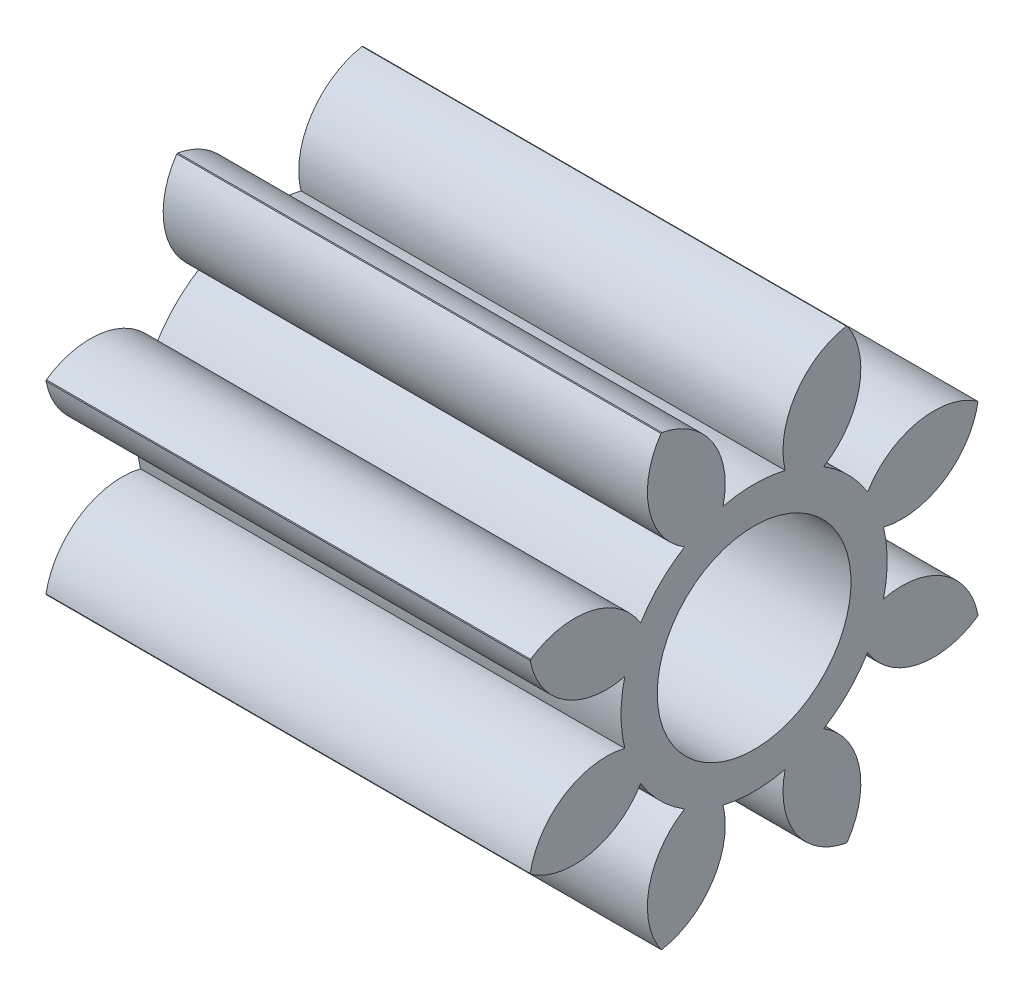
ISO-10303-21;
HEADER;
FILE_DESCRIPTION(('STEP AP214'),'2;1');
FILE_NAME('part.step','',(''),(''),'','','');
FILE_SCHEMA(('AUTOMOTIVE_DESIGN { 1 0 10303 214 1 1 1 1 }'));
ENDSEC;
DATA;
#1=APPLICATION_CONTEXT('core data for automotive mechanical design processes');
#2=APPLICATION_PROTOCOL_DEFINITION('international standard','automotive_design',2000,#1);
#3=PRODUCT_CONTEXT('',#1,'mechanical');
#4=PRODUCT('Part','Part','',(#3));
#5=PRODUCT_RELATED_PRODUCT_CATEGORY('part','',(#4));
#6=PRODUCT_DEFINITION_FORMATION('','',#4);
#7=PRODUCT_DEFINITION_CONTEXT('part definition',#1,'design');
#8=PRODUCT_DEFINITION('design','',#6,#7);
#9=PRODUCT_DEFINITION_SHAPE('','',#8);
#10=(LENGTH_UNIT() NAMED_UNIT(*) SI_UNIT(.MILLI.,.METRE.));
#11=(NAMED_UNIT(*) PLANE_ANGLE_UNIT() SI_UNIT($,.RADIAN.));
#12=(NAMED_UNIT(*) SI_UNIT($,.STERADIAN.) SOLID_ANGLE_UNIT());
#13=UNCERTAINTY_MEASURE_WITH_UNIT(LENGTH_MEASURE(1.E-05),#10,'distance_accuracy_value','');
#14=(GEOMETRIC_REPRESENTATION_CONTEXT(3) GLOBAL_UNCERTAINTY_ASSIGNED_CONTEXT((#13)) GLOBAL_UNIT_ASSIGNED_CONTEXT((#10,
#11,#12)) REPRESENTATION_CONTEXT('',''));
#15=CARTESIAN_POINT('',(0.,0.,0.));
#16=DIRECTION('',(0.,0.,1.));
#17=DIRECTION('',(1.,0.,0.));
#18=AXIS2_PLACEMENT_3D('',#15,#16,#17);
#19=CARTESIAN_POINT('',(5.,0.,0.));
#20=DIRECTION('',(-1.,0.,0.));
#21=DIRECTION('',(0.,0.,1.));
#22=AXIS2_PLACEMENT_3D('',#19,#20,#21);
#23=PLANE('',#22);
#24=CARTESIAN_POINT('',(5.,0.30187640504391,1.85498235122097));
#25=DIRECTION('',(-1.,0.,0.));
#26=DIRECTION('',(0.,0.707106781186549,-0.707106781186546));
#27=AXIS2_PLACEMENT_3D('',#24,#25,#26);
#28=CIRCLE('',#27,0.799999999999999);
#29=CARTESIAN_POINT('',(5.,0.961431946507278,2.30773668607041));
#30=VERTEX_POINT('',#29);
#31=CARTESIAN_POINT('',(5.,0.717795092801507,1.17159984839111));
#32=VERTEX_POINT('',#31);
#33=EDGE_CURVE('E433',#30,#32,#28,.T.);
#34=ORIENTED_EDGE('',*,*,#33,.F.);
#35=CARTESIAN_POINT('',(5.,0.,0.));
#36=DIRECTION('',(-1.,0.,0.));
#37=DIRECTION('',(0.,0.,1.));
#38=AXIS2_PLACEMENT_3D('',#35,#36,#37);
#39=CIRCLE('',#38,2.5);
#40=CARTESIAN_POINT('',(5.,0.951981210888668,2.31165130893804));
#41=VERTEX_POINT('',#40);
#42=EDGE_CURVE('E326',#41,#30,#39,.T.);
#43=ORIENTED_EDGE('',*,*,#42,.F.);
#44=CARTESIAN_POINT('',(5.,1.09821174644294,1.52512945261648));
#45=DIRECTION('',(-1.,0.,0.));
#46=DIRECTION('',(0.,1.,0.));
#47=AXIS2_PLACEMENT_3D('',#44,#45,#46);
#48=CIRCLE('',#47,0.799999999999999);
#49=CARTESIAN_POINT('',(5.,0.320888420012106,1.33600397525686));
#50=VERTEX_POINT('',#49);
#51=EDGE_CURVE('E418',#50,#41,#48,.T.);
#52=ORIENTED_EDGE('',*,*,#51,.F.);
#53=CARTESIAN_POINT('',(5.,0.,0.));
#54=DIRECTION('',(-1.,0.,0.));
#55=DIRECTION('',(0.,1.,0.));
#56=AXIS2_PLACEMENT_3D('',#53,#54,#55);
#57=CIRCLE('',#56,1.374);
#58=CARTESIAN_POINT('',(5.,-0.320888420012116,1.33600397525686));
#59=VERTEX_POINT('',#58);
#60=EDGE_CURVE('E422',#59,#50,#57,.T.);
#61=ORIENTED_EDGE('',*,*,#60,.F.);
#62=CARTESIAN_POINT('',(5.,-1.09821174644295,1.52512945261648));
#63=DIRECTION('',(-1.,0.,0.));
#64=DIRECTION('',(0.,1.,0.));
#65=AXIS2_PLACEMENT_3D('',#62,#63,#64);
#66=CIRCLE('',#65,0.799999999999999);
#67=CARTESIAN_POINT('',(5.,-0.951981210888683,2.31165130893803));
#68=VERTEX_POINT('',#67);
#69=EDGE_CURVE('E420',#68,#59,#66,.T.);
#70=ORIENTED_EDGE('',*,*,#69,.F.);
#71=CARTESIAN_POINT('',(5.,-0.961431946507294,2.3077366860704));
#72=VERTEX_POINT('',#71);
#73=EDGE_CURVE('E300',#72,#68,#39,.T.);
#74=ORIENTED_EDGE('',*,*,#73,.F.);
#75=CARTESIAN_POINT('',(5.,-0.301876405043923,1.85498235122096));
#76=DIRECTION('',(-1.,0.,0.));
#77=DIRECTION('',(0.,0.707106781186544,0.707106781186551));
#78=AXIS2_PLACEMENT_3D('',#75,#76,#77);
#79=CIRCLE('',#78,0.799999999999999);
#80=CARTESIAN_POINT('',(5.,-0.717795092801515,1.17159984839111));
#81=VERTEX_POINT('',#80);
#82=EDGE_CURVE('E404',#81,#72,#79,.T.);
#83=ORIENTED_EDGE('',*,*,#82,.F.);
#84=CARTESIAN_POINT('',(5.,0.,0.));
#85=DIRECTION('',(-1.,0.,0.));
#86=DIRECTION('',(0.,0.707106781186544,0.707106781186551));
#87=AXIS2_PLACEMENT_3D('',#84,#85,#86);
#88=CIRCLE('',#87,1.374);
#89=CARTESIAN_POINT('',(5.,-1.17159984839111,0.717795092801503));
#90=VERTEX_POINT('',#89);
#91=EDGE_CURVE('E408',#90,#81,#88,.T.);
#92=ORIENTED_EDGE('',*,*,#91,.F.);
#93=CARTESIAN_POINT('',(5.,-1.85498235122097,0.301876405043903));
#94=DIRECTION('',(-1.,0.,0.));
#95=DIRECTION('',(0.,0.707106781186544,0.707106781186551));
#96=AXIS2_PLACEMENT_3D('',#93,#94,#95);
#97=CIRCLE('',#96,0.799999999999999);
#98=CARTESIAN_POINT('',(5.,-2.30773668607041,0.961431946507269));
#99=VERTEX_POINT('',#98);
#100=EDGE_CURVE('E406',#99,#90,#97,.T.);
#101=ORIENTED_EDGE('',*,*,#100,.F.);
#102=CARTESIAN_POINT('',(5.,-2.31165130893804,0.951981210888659));
#103=VERTEX_POINT('',#102);
#104=EDGE_CURVE('E337',#103,#99,#39,.T.);
#105=ORIENTED_EDGE('',*,*,#104,.F.);
#106=CARTESIAN_POINT('',(5.,-1.52512945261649,1.09821174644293));
#107=DIRECTION('',(-1.,0.,0.));
#108=DIRECTION('',(0.,0.,1.));
#109=AXIS2_PLACEMENT_3D('',#106,#107,#108);
#110=CIRCLE('',#109,0.799999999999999);
#111=CARTESIAN_POINT('',(5.,-1.33600397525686,0.320888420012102));
#112=VERTEX_POINT('',#111);
#113=EDGE_CURVE('E390',#112,#103,#110,.T.);
#114=ORIENTED_EDGE('',*,*,#113,.F.);
#115=CARTESIAN_POINT('',(5.,0.,0.));
#116=DIRECTION('',(-1.,0.,0.));
#117=DIRECTION('',(0.,0.,1.));
#118=AXIS2_PLACEMENT_3D('',#115,#116,#117);
#119=CIRCLE('',#118,1.374);
#120=CARTESIAN_POINT('',(5.,-1.33600397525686,-0.32088842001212));
#121=VERTEX_POINT('',#120);
#122=EDGE_CURVE('E394',#121,#112,#119,.T.);
#123=ORIENTED_EDGE('',*,*,#122,.F.);
#124=CARTESIAN_POINT('',(5.,-1.52512945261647,-1.09821174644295));
#125=DIRECTION('',(-1.,0.,0.));
#126=DIRECTION('',(0.,0.,1.));
#127=AXIS2_PLACEMENT_3D('',#124,#125,#126);
#128=CIRCLE('',#127,0.799999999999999);
#129=CARTESIAN_POINT('',(5.,-2.31165130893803,-0.951981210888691));
#130=VERTEX_POINT('',#129);
#131=EDGE_CURVE('E392',#130,#121,#128,.T.);
#132=ORIENTED_EDGE('',*,*,#131,.F.);
#133=CARTESIAN_POINT('',(5.,-2.3077366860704,-0.961431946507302));
#134=VERTEX_POINT('',#133);
#135=EDGE_CURVE('E339',#134,#130,#39,.T.);
#136=ORIENTED_EDGE('',*,*,#135,.F.);
#137=CARTESIAN_POINT('',(5.,-1.85498235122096,-0.301876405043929));
#138=DIRECTION('',(-1.,0.,0.));
#139=DIRECTION('',(0.,-0.707106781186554,0.707106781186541));
#140=AXIS2_PLACEMENT_3D('',#137,#138,#139);
#141=CIRCLE('',#140,0.799999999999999);
#142=CARTESIAN_POINT('',(5.,-1.1715998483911,-0.71779509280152));
#143=VERTEX_POINT('',#142);
#144=EDGE_CURVE('E372',#143,#134,#141,.T.);
#145=ORIENTED_EDGE('',*,*,#144,.F.);
#146=CARTESIAN_POINT('',(5.,0.,0.));
#147=DIRECTION('',(-1.,0.,0.));
#148=DIRECTION('',(0.,-0.707106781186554,0.707106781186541));
#149=AXIS2_PLACEMENT_3D('',#146,#147,#148);
#150=CIRCLE('',#149,1.374);
#151=CARTESIAN_POINT('',(5.,-0.717795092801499,-1.17159984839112));
#152=VERTEX_POINT('',#151);
#153=EDGE_CURVE('E369',#152,#143,#150,.T.);
#154=ORIENTED_EDGE('',*,*,#153,.F.);
#155=CARTESIAN_POINT('',(5.,-0.301876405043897,-1.85498235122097));
#156=DIRECTION('',(-1.,0.,0.));
#157=DIRECTION('',(0.,-0.707106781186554,0.707106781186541));
#158=AXIS2_PLACEMENT_3D('',#155,#156,#157);
#159=CIRCLE('',#158,0.799999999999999);
#160=CARTESIAN_POINT('',(5.,-0.961431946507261,-2.30773668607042));
#161=VERTEX_POINT('',#160);
#162=EDGE_CURVE('E367',#161,#152,#159,.T.);
#163=ORIENTED_EDGE('',*,*,#162,.F.);
#164=CARTESIAN_POINT('',(5.,-0.951981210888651,-2.31165130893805));
#165=VERTEX_POINT('',#164);
#166=EDGE_CURVE('E325',#165,#161,#39,.T.);
#167=ORIENTED_EDGE('',*,*,#166,.F.);
#168=CARTESIAN_POINT('',(5.,-1.09821174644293,-1.52512945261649));
#169=DIRECTION('',(-1.,0.,0.));
#170=DIRECTION('',(0.,-1.,0.));
#171=AXIS2_PLACEMENT_3D('',#168,#169,#170);
#172=CIRCLE('',#171,0.799999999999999);
#173=CARTESIAN_POINT('',(5.,-0.320888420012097,-1.33600397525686));
#174=VERTEX_POINT('',#173);
#175=EDGE_CURVE('E365',#174,#165,#172,.T.);
#176=ORIENTED_EDGE('',*,*,#175,.F.);
#177=CARTESIAN_POINT('',(5.,0.,0.));
#178=DIRECTION('',(-1.,0.,0.));
#179=DIRECTION('',(0.,-1.,0.));
#180=AXIS2_PLACEMENT_3D('',#177,#178,#179);
#181=CIRCLE('',#180,1.374);
#182=CARTESIAN_POINT('',(5.,0.320888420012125,-1.33600397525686));
#183=VERTEX_POINT('',#182);
#184=EDGE_CURVE('E615',#183,#174,#181,.T.);
#185=ORIENTED_EDGE('',*,*,#184,.F.);
#186=CARTESIAN_POINT('',(5.,1.09821174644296,-1.52512945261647));
#187=DIRECTION('',(-1.,0.,0.));
#188=DIRECTION('',(0.,-1.,0.));
#189=AXIS2_PLACEMENT_3D('',#186,#187,#188);
#190=CIRCLE('',#189,0.799999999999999);
#191=CARTESIAN_POINT('',(5.,0.9519812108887,-2.31165130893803));
#192=VERTEX_POINT('',#191);
#193=EDGE_CURVE('E613',#192,#183,#190,.T.);
#194=ORIENTED_EDGE('',*,*,#193,.F.);
#195=CARTESIAN_POINT('',(5.,0.96143194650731,-2.3077366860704));
#196=VERTEX_POINT('',#195);
#197=EDGE_CURVE('E320',#196,#192,#39,.T.);
#198=ORIENTED_EDGE('',*,*,#197,.F.);
#199=CARTESIAN_POINT('',(5.,0.301876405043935,-1.85498235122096));
#200=DIRECTION('',(-1.,0.,0.));
#201=DIRECTION('',(0.,-0.707106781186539,-0.707106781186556));
#202=AXIS2_PLACEMENT_3D('',#199,#200,#201);
#203=CIRCLE('',#202,0.799999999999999);
#204=CARTESIAN_POINT('',(5.,0.717795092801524,-1.1715998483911));
#205=VERTEX_POINT('',#204);
#206=EDGE_CURVE('E257',#205,#196,#203,.T.);
#207=ORIENTED_EDGE('',*,*,#206,.F.);
#208=CARTESIAN_POINT('',(5.,0.,0.));
#209=DIRECTION('',(-1.,0.,0.));
#210=DIRECTION('',(0.,-0.707106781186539,-0.707106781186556));
#211=AXIS2_PLACEMENT_3D('',#208,#209,#210);
#212=CIRCLE('',#211,1.374);
#213=CARTESIAN_POINT('',(5.,1.17159984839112,-0.717795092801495));
#214=VERTEX_POINT('',#213);
#215=EDGE_CURVE('E604',#214,#205,#212,.T.);
#216=ORIENTED_EDGE('',*,*,#215,.F.);
#217=CARTESIAN_POINT('',(5.,1.85498235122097,-0.30187640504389));
#218=DIRECTION('',(-1.,0.,0.));
#219=DIRECTION('',(0.,-0.707106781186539,-0.707106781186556));
#220=AXIS2_PLACEMENT_3D('',#217,#218,#219);
#221=CIRCLE('',#220,0.799999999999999);
#222=CARTESIAN_POINT('',(5.,2.30773668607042,-0.961431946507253));
#223=VERTEX_POINT('',#222);
#224=EDGE_CURVE('E244',#223,#214,#221,.T.);
#225=ORIENTED_EDGE('',*,*,#224,.F.);
#226=CARTESIAN_POINT('',(5.,2.31165130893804,-0.951981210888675));
#227=VERTEX_POINT('',#226);
#228=EDGE_CURVE('E273',#227,#223,#39,.T.);
#229=ORIENTED_EDGE('',*,*,#228,.F.);
#230=CARTESIAN_POINT('',(5.,1.52512945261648,-1.09821174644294));
#231=DIRECTION('',(-1.,0.,0.));
#232=DIRECTION('',(0.,0.,-1.));
#233=AXIS2_PLACEMENT_3D('',#230,#231,#232);
#234=CIRCLE('',#233,0.799999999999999);
#235=CARTESIAN_POINT('',(5.,1.33600397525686,-0.320888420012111));
#236=VERTEX_POINT('',#235);
#237=EDGE_CURVE('E468',#236,#227,#234,.T.);
#238=ORIENTED_EDGE('',*,*,#237,.F.);
#239=CARTESIAN_POINT('',(5.,0.,0.));
#240=DIRECTION('',(-1.,0.,0.));
#241=DIRECTION('',(0.,0.,-1.));
#242=AXIS2_PLACEMENT_3D('',#239,#240,#241);
#243=CIRCLE('',#242,1.374);
#244=CARTESIAN_POINT('',(5.,1.33600397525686,0.320888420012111));
#245=VERTEX_POINT('',#244);
#246=EDGE_CURVE('E472',#245,#236,#243,.T.);
#247=ORIENTED_EDGE('',*,*,#246,.F.);
#248=CARTESIAN_POINT('',(5.,1.52512945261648,1.09821174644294));
#249=DIRECTION('',(-1.,0.,0.));
#250=DIRECTION('',(0.,0.,-1.));
#251=AXIS2_PLACEMENT_3D('',#248,#249,#250);
#252=CIRCLE('',#251,0.799999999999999);
#253=CARTESIAN_POINT('',(5.,2.31165130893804,0.951981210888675));
#254=VERTEX_POINT('',#253);
#255=EDGE_CURVE('E470',#254,#245,#252,.T.);
#256=ORIENTED_EDGE('',*,*,#255,.F.);
#257=CARTESIAN_POINT('',(5.,2.30773668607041,0.961431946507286));
#258=VERTEX_POINT('',#257);
#259=EDGE_CURVE('E315',#258,#254,#39,.T.);
#260=ORIENTED_EDGE('',*,*,#259,.F.);
#261=CARTESIAN_POINT('',(5.,1.85498235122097,0.301876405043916));
#262=DIRECTION('',(-1.,0.,0.));
#263=DIRECTION('',(0.,0.707106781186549,-0.707106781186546));
#264=AXIS2_PLACEMENT_3D('',#261,#262,#263);
#265=CIRCLE('',#264,0.799999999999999);
#266=CARTESIAN_POINT('',(5.,1.17159984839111,0.717795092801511));
#267=VERTEX_POINT('',#266);
#268=EDGE_CURVE('E431',#267,#258,#265,.T.);
#269=ORIENTED_EDGE('',*,*,#268,.F.);
#270=CARTESIAN_POINT('',(5.,0.,0.));
#271=DIRECTION('',(-1.,0.,0.));
#272=DIRECTION('',(0.,0.707106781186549,-0.707106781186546));
#273=AXIS2_PLACEMENT_3D('',#270,#271,#272);
#274=CIRCLE('',#273,1.374);
#275=EDGE_CURVE('E435',#32,#267,#274,.T.);
#276=ORIENTED_EDGE('',*,*,#275,.F.);
#277=EDGE_LOOP('',(#34,#43,#52,#61,#70,#74,#83,#92,#101,#105,#114,#123,#132,#136,#145,#154,#163,
#167,#176,#185,#194,#198,#207,#216,#225,#229,#238,#247,#256,#260,#269,#276));
#278=FACE_BOUND('',#277,.T.);
#279=CARTESIAN_POINT('',(5.,0.,0.));
#280=DIRECTION('',(-1.,0.,0.));
#281=DIRECTION('',(0.,0.,1.));
#282=AXIS2_PLACEMENT_3D('',#279,#280,#281);
#283=CIRCLE('',#282,0.999999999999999);
#284=CARTESIAN_POINT('',(5.,0.,0.999999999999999));
#285=VERTEX_POINT('',#284);
#286=EDGE_CURVE('E598',#285,#285,#283,.F.);
#287=ORIENTED_EDGE('',*,*,#286,.F.);
#288=EDGE_LOOP('',(#287));
#289=FACE_BOUND('',#288,.T.);
#290=ADVANCED_FACE('F28',(#278,#289),#23,.F.);
#291=CARTESIAN_POINT('',(0.,0.,0.));
#292=DIRECTION('',(1.,0.,0.));
#293=DIRECTION('',(0.,0.,-1.));
#294=AXIS2_PLACEMENT_3D('',#291,#292,#293);
#295=PLANE('',#294);
#296=CARTESIAN_POINT('',(0.,0.30187640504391,1.85498235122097));
#297=DIRECTION('',(1.,0.,0.));
#298=DIRECTION('',(0.,0.,-1.));
#299=AXIS2_PLACEMENT_3D('',#296,#297,#298);
#300=CIRCLE('',#299,0.799999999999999);
#301=CARTESIAN_POINT('',(0.,0.717795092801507,1.17159984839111));
#302=VERTEX_POINT('',#301);
#303=CARTESIAN_POINT('',(0.,0.961431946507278,2.30773668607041));
#304=VERTEX_POINT('',#303);
#305=EDGE_CURVE('E11',#302,#304,#300,.T.);
#306=ORIENTED_EDGE('',*,*,#305,.F.);
#307=CARTESIAN_POINT('',(0.,0.,0.));
#308=DIRECTION('',(-1.,0.,0.));
#309=DIRECTION('',(0.,0.707106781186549,-0.707106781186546));
#310=AXIS2_PLACEMENT_3D('',#307,#308,#309);
#311=CIRCLE('',#310,1.374);
#312=CARTESIAN_POINT('',(0.,1.17159984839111,0.717795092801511));
#313=VERTEX_POINT('',#312);
#314=EDGE_CURVE('E428',#302,#313,#311,.T.);
#315=ORIENTED_EDGE('',*,*,#314,.T.);
#316=CARTESIAN_POINT('',(0.,1.85498235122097,0.301876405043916));
#317=DIRECTION('',(-1.,0.,0.));
#318=DIRECTION('',(0.,0.707106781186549,-0.707106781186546));
#319=AXIS2_PLACEMENT_3D('',#316,#317,#318);
#320=CIRCLE('',#319,0.799999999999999);
#321=CARTESIAN_POINT('',(0.,2.30773668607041,0.961431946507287));
#322=VERTEX_POINT('',#321);
#323=EDGE_CURVE('E43',#313,#322,#320,.T.);
#324=ORIENTED_EDGE('',*,*,#323,.T.);
#325=CARTESIAN_POINT('',(0.,0.,0.));
#326=DIRECTION('',(-1.,0.,0.));
#327=DIRECTION('',(0.,0.,1.));
#328=AXIS2_PLACEMENT_3D('',#325,#326,#327);
#329=CIRCLE('',#328,2.5);
#330=CARTESIAN_POINT('',(0.,2.31165130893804,0.951981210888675));
#331=VERTEX_POINT('',#330);
#332=EDGE_CURVE('E313',#322,#331,#329,.T.);
#333=ORIENTED_EDGE('',*,*,#332,.T.);
#334=CARTESIAN_POINT('',(0.,1.52512945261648,1.09821174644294));
#335=DIRECTION('',(1.,0.,0.));
#336=DIRECTION('',(0.,0.,-1.));
#337=AXIS2_PLACEMENT_3D('',#334,#335,#336);
#338=CIRCLE('',#337,0.799999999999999);
#339=CARTESIAN_POINT('',(0.,1.33600397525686,0.320888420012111));
#340=VERTEX_POINT('',#339);
#341=EDGE_CURVE('E268',#340,#331,#338,.T.);
#342=ORIENTED_EDGE('',*,*,#341,.F.);
#343=CARTESIAN_POINT('',(0.,0.,0.));
#344=DIRECTION('',(-1.,0.,0.));
#345=DIRECTION('',(0.,0.,-1.));
#346=AXIS2_PLACEMENT_3D('',#343,#344,#345);
#347=CIRCLE('',#346,1.374);
#348=CARTESIAN_POINT('',(0.,1.33600397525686,-0.320888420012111));
#349=VERTEX_POINT('',#348);
#350=EDGE_CURVE('E465',#340,#349,#347,.T.);
#351=ORIENTED_EDGE('',*,*,#350,.T.);
#352=CARTESIAN_POINT('',(0.,1.52512945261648,-1.09821174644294));
#353=DIRECTION('',(-1.,0.,0.));
#354=DIRECTION('',(0.,0.,-1.));
#355=AXIS2_PLACEMENT_3D('',#352,#353,#354);
#356=CIRCLE('',#355,0.799999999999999);
#357=CARTESIAN_POINT('',(0.,2.31165130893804,-0.951981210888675));
#358=VERTEX_POINT('',#357);
#359=EDGE_CURVE('E463',#349,#358,#356,.T.);
#360=ORIENTED_EDGE('',*,*,#359,.T.);
#361=CARTESIAN_POINT('',(0.,2.30773668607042,-0.961431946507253));
#362=VERTEX_POINT('',#361);
#363=EDGE_CURVE('E266',#358,#362,#329,.T.);
#364=ORIENTED_EDGE('',*,*,#363,.T.);
#365=CARTESIAN_POINT('',(0.,1.85498235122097,-0.30187640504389));
#366=DIRECTION('',(1.,0.,0.));
#367=DIRECTION('',(0.,0.,-1.));
#368=AXIS2_PLACEMENT_3D('',#365,#366,#367);
#369=CIRCLE('',#368,0.799999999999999);
#370=CARTESIAN_POINT('',(0.,1.17159984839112,-0.717795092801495));
#371=VERTEX_POINT('',#370);
#372=EDGE_CURVE('E241',#371,#362,#369,.T.);
#373=ORIENTED_EDGE('',*,*,#372,.F.);
#374=CARTESIAN_POINT('',(0.,0.,0.));
#375=DIRECTION('',(-1.,0.,0.));
#376=DIRECTION('',(0.,-0.707106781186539,-0.707106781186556));
#377=AXIS2_PLACEMENT_3D('',#374,#375,#376);
#378=CIRCLE('',#377,1.374);
#379=CARTESIAN_POINT('',(0.,0.717795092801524,-1.1715998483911));
#380=VERTEX_POINT('',#379);
#381=EDGE_CURVE('E252',#371,#380,#378,.T.);
#382=ORIENTED_EDGE('',*,*,#381,.T.);
#383=CARTESIAN_POINT('',(0.,0.301876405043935,-1.85498235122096));
#384=DIRECTION('',(-1.,0.,0.));
#385=DIRECTION('',(0.,-0.707106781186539,-0.707106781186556));
#386=AXIS2_PLACEMENT_3D('',#383,#384,#385);
#387=CIRCLE('',#386,0.799999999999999);
#388=CARTESIAN_POINT('',(0.,0.96143194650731,-2.3077366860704));
#389=VERTEX_POINT('',#388);
#390=EDGE_CURVE('E258',#380,#389,#387,.T.);
#391=ORIENTED_EDGE('',*,*,#390,.T.);
#392=CARTESIAN_POINT('',(0.,0.951981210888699,-2.31165130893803));
#393=VERTEX_POINT('',#392);
#394=EDGE_CURVE('E316',#389,#393,#329,.T.);
#395=ORIENTED_EDGE('',*,*,#394,.T.);
#396=CARTESIAN_POINT('',(0.,1.09821174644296,-1.52512945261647));
#397=DIRECTION('',(1.,0.,0.));
#398=DIRECTION('',(0.,0.,-1.));
#399=AXIS2_PLACEMENT_3D('',#396,#397,#398);
#400=CIRCLE('',#399,0.799999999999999);
#401=CARTESIAN_POINT('',(0.,0.320888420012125,-1.33600397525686));
#402=VERTEX_POINT('',#401);
#403=EDGE_CURVE('E267',#402,#393,#400,.T.);
#404=ORIENTED_EDGE('',*,*,#403,.F.);
#405=CARTESIAN_POINT('',(0.,0.,0.));
#406=DIRECTION('',(-1.,0.,0.));
#407=DIRECTION('',(0.,-1.,0.));
#408=AXIS2_PLACEMENT_3D('',#405,#406,#407);
#409=CIRCLE('',#408,1.374);
#410=CARTESIAN_POINT('',(0.,-0.320888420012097,-1.33600397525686));
#411=VERTEX_POINT('',#410);
#412=EDGE_CURVE('E609',#402,#411,#409,.T.);
#413=ORIENTED_EDGE('',*,*,#412,.T.);
#414=CARTESIAN_POINT('',(0.,-1.09821174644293,-1.52512945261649));
#415=DIRECTION('',(-1.,0.,0.));
#416=DIRECTION('',(0.,-1.,0.));
#417=AXIS2_PLACEMENT_3D('',#414,#415,#416);
#418=CIRCLE('',#417,0.799999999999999);
#419=CARTESIAN_POINT('',(0.,-0.951981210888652,-2.31165130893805));
#420=VERTEX_POINT('',#419);
#421=EDGE_CURVE('E247',#411,#420,#418,.T.);
#422=ORIENTED_EDGE('',*,*,#421,.T.);
#423=CARTESIAN_POINT('',(0.,-0.961431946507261,-2.30773668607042));
#424=VERTEX_POINT('',#423);
#425=EDGE_CURVE('E638',#420,#424,#329,.T.);
#426=ORIENTED_EDGE('',*,*,#425,.T.);
#427=CARTESIAN_POINT('',(0.,-0.301876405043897,-1.85498235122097));
#428=DIRECTION('',(1.,0.,0.));
#429=DIRECTION('',(0.,0.,-1.));
#430=AXIS2_PLACEMENT_3D('',#427,#428,#429);
#431=CIRCLE('',#430,0.799999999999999);
#432=CARTESIAN_POINT('',(0.,-0.717795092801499,-1.17159984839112));
#433=VERTEX_POINT('',#432);
#434=EDGE_CURVE('E270',#433,#424,#431,.T.);
#435=ORIENTED_EDGE('',*,*,#434,.F.);
#436=CARTESIAN_POINT('',(0.,0.,0.));
#437=DIRECTION('',(-1.,0.,0.));
#438=DIRECTION('',(0.,-0.707106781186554,0.707106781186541));
#439=AXIS2_PLACEMENT_3D('',#436,#437,#438);
#440=CIRCLE('',#439,1.374);
#441=CARTESIAN_POINT('',(0.,-1.1715998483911,-0.71779509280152));
#442=VERTEX_POINT('',#441);
#443=EDGE_CURVE('E376',#433,#442,#440,.T.);
#444=ORIENTED_EDGE('',*,*,#443,.T.);
#445=CARTESIAN_POINT('',(0.,-1.85498235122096,-0.301876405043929));
#446=DIRECTION('',(-1.,0.,0.));
#447=DIRECTION('',(0.,-0.707106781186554,0.707106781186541));
#448=AXIS2_PLACEMENT_3D('',#445,#446,#447);
#449=CIRCLE('',#448,0.799999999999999);
#450=CARTESIAN_POINT('',(0.,-2.3077366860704,-0.961431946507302));
#451=VERTEX_POINT('',#450);
#452=EDGE_CURVE('E622',#442,#451,#449,.T.);
#453=ORIENTED_EDGE('',*,*,#452,.T.);
#454=CARTESIAN_POINT('',(0.,-2.31165130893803,-0.951981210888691));
#455=VERTEX_POINT('',#454);
#456=EDGE_CURVE('E311',#451,#455,#329,.T.);
#457=ORIENTED_EDGE('',*,*,#456,.T.);
#458=CARTESIAN_POINT('',(0.,-1.52512945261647,-1.09821174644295));
#459=DIRECTION('',(1.,0.,0.));
#460=DIRECTION('',(0.,0.,-1.));
#461=AXIS2_PLACEMENT_3D('',#458,#459,#460);
#462=CIRCLE('',#461,0.799999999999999);
#463=CARTESIAN_POINT('',(0.,-1.33600397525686,-0.32088842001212));
#464=VERTEX_POINT('',#463);
#465=EDGE_CURVE('E278',#464,#455,#462,.T.);
#466=ORIENTED_EDGE('',*,*,#465,.F.);
#467=CARTESIAN_POINT('',(0.,0.,0.));
#468=DIRECTION('',(-1.,0.,0.));
#469=DIRECTION('',(0.,0.,1.));
#470=AXIS2_PLACEMENT_3D('',#467,#468,#469);
#471=CIRCLE('',#470,1.374);
#472=CARTESIAN_POINT('',(0.,-1.33600397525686,0.320888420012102));
#473=VERTEX_POINT('',#472);
#474=EDGE_CURVE('E387',#464,#473,#471,.T.);
#475=ORIENTED_EDGE('',*,*,#474,.T.);
#476=CARTESIAN_POINT('',(0.,-1.52512945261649,1.09821174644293));
#477=DIRECTION('',(-1.,0.,0.));
#478=DIRECTION('',(0.,0.,1.));
#479=AXIS2_PLACEMENT_3D('',#476,#477,#478);
#480=CIRCLE('',#479,0.799999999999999);
#481=CARTESIAN_POINT('',(0.,-2.31165130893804,0.95198121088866));
#482=VERTEX_POINT('',#481);
#483=EDGE_CURVE('E384',#473,#482,#480,.T.);
#484=ORIENTED_EDGE('',*,*,#483,.T.);
#485=CARTESIAN_POINT('',(0.,-2.30773668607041,0.96143194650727));
#486=VERTEX_POINT('',#485);
#487=EDGE_CURVE('E307',#482,#486,#329,.T.);
#488=ORIENTED_EDGE('',*,*,#487,.T.);
#489=CARTESIAN_POINT('',(0.,-1.85498235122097,0.301876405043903));
#490=DIRECTION('',(1.,0.,0.));
#491=DIRECTION('',(0.,0.,-1.));
#492=AXIS2_PLACEMENT_3D('',#489,#490,#491);
#493=CIRCLE('',#492,0.799999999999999);
#494=CARTESIAN_POINT('',(0.,-1.17159984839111,0.717795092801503));
#495=VERTEX_POINT('',#494);
#496=EDGE_CURVE('E280',#495,#486,#493,.T.);
#497=ORIENTED_EDGE('',*,*,#496,.F.);
#498=CARTESIAN_POINT('',(0.,0.,0.));
#499=DIRECTION('',(-1.,0.,0.));
#500=DIRECTION('',(0.,0.707106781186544,0.707106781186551));
#501=AXIS2_PLACEMENT_3D('',#498,#499,#500);
#502=CIRCLE('',#501,1.374);
#503=CARTESIAN_POINT('',(0.,-0.717795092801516,1.17159984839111));
#504=VERTEX_POINT('',#503);
#505=EDGE_CURVE('E402',#495,#504,#502,.T.);
#506=ORIENTED_EDGE('',*,*,#505,.T.);
#507=CARTESIAN_POINT('',(0.,-0.301876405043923,1.85498235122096));
#508=DIRECTION('',(-1.,0.,0.));
#509=DIRECTION('',(0.,0.707106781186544,0.707106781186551));
#510=AXIS2_PLACEMENT_3D('',#507,#508,#509);
#511=CIRCLE('',#510,0.799999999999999);
#512=CARTESIAN_POINT('',(0.,-0.961431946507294,2.3077366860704));
#513=VERTEX_POINT('',#512);
#514=EDGE_CURVE('E306',#504,#513,#511,.T.);
#515=ORIENTED_EDGE('',*,*,#514,.T.);
#516=CARTESIAN_POINT('',(0.,-0.951981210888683,2.31165130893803));
#517=VERTEX_POINT('',#516);
#518=EDGE_CURVE('E298',#513,#517,#329,.T.);
#519=ORIENTED_EDGE('',*,*,#518,.T.);
#520=CARTESIAN_POINT('',(0.,-1.09821174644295,1.52512945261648));
#521=DIRECTION('',(1.,0.,0.));
#522=DIRECTION('',(0.,0.,-1.));
#523=AXIS2_PLACEMENT_3D('',#520,#521,#522);
#524=CIRCLE('',#523,0.799999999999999);
#525=CARTESIAN_POINT('',(0.,-0.320888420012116,1.33600397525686));
#526=VERTEX_POINT('',#525);
#527=EDGE_CURVE('E36',#526,#517,#524,.T.);
#528=ORIENTED_EDGE('',*,*,#527,.F.);
#529=CARTESIAN_POINT('',(0.,0.,0.));
#530=DIRECTION('',(-1.,0.,0.));
#531=DIRECTION('',(0.,1.,0.));
#532=AXIS2_PLACEMENT_3D('',#529,#530,#531);
#533=CIRCLE('',#532,1.374);
#534=CARTESIAN_POINT('',(0.,0.320888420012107,1.33600397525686));
#535=VERTEX_POINT('',#534);
#536=EDGE_CURVE('E416',#526,#535,#533,.T.);
#537=ORIENTED_EDGE('',*,*,#536,.T.);
#538=CARTESIAN_POINT('',(0.,1.09821174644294,1.52512945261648));
#539=DIRECTION('',(-1.,0.,0.));
#540=DIRECTION('',(0.,1.,0.));
#541=AXIS2_PLACEMENT_3D('',#538,#539,#540);
#542=CIRCLE('',#541,0.799999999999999);
#543=CARTESIAN_POINT('',(0.,0.951981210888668,2.31165130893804));
#544=VERTEX_POINT('',#543);
#545=EDGE_CURVE('E51',#535,#544,#542,.T.);
#546=ORIENTED_EDGE('',*,*,#545,.T.);
#547=EDGE_CURVE('E308',#544,#304,#329,.T.);
#548=ORIENTED_EDGE('',*,*,#547,.T.);
#549=EDGE_LOOP('',(#306,#315,#324,#333,#342,#351,#360,#364,#373,#382,#391,#395,#404,#413,#422,
#426,#435,#444,#453,#457,#466,#475,#484,#488,#497,#506,#515,#519,#528,#537,#546,#548));
#550=FACE_BOUND('',#549,.T.);
#551=CARTESIAN_POINT('',(0.,0.,0.));
#552=DIRECTION('',(1.,0.,0.));
#553=DIRECTION('',(0.,0.,-1.));
#554=AXIS2_PLACEMENT_3D('',#551,#552,#553);
#555=CIRCLE('',#554,0.999999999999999);
#556=CARTESIAN_POINT('',(0.,0.,-0.999999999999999));
#557=VERTEX_POINT('',#556);
#558=EDGE_CURVE('E31',#557,#557,#555,.F.);
#559=ORIENTED_EDGE('',*,*,#558,.F.);
#560=EDGE_LOOP('',(#559));
#561=FACE_BOUND('',#560,.T.);
#562=ADVANCED_FACE('F262',(#550,#561),#295,.F.);
#563=CARTESIAN_POINT('',(-10.,0.,0.));
#564=DIRECTION('',(-1.,0.,0.));
#565=DIRECTION('',(0.,0.,1.));
#566=AXIS2_PLACEMENT_3D('',#563,#564,#565);
#567=CYLINDRICAL_SURFACE('',#566,2.5);
#568=DIRECTION('',(-1.,0.,0.));
#569=VECTOR('',#568,1.);
#570=CARTESIAN_POINT('',(2.5,0.961431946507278,2.30773668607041));
#571=LINE('',#570,#569);
#572=EDGE_CURVE('E461',#304,#30,#571,.F.);
#573=ORIENTED_EDGE('',*,*,#572,.F.);
#574=ORIENTED_EDGE('',*,*,#547,.F.);
#575=DIRECTION('',(-1.,0.,0.));
#576=VECTOR('',#575,1.);
#577=CARTESIAN_POINT('',(2.5,0.951981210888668,2.31165130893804));
#578=LINE('',#577,#576);
#579=EDGE_CURVE('E301',#41,#544,#578,.T.);
#580=ORIENTED_EDGE('',*,*,#579,.F.);
#581=ORIENTED_EDGE('',*,*,#42,.T.);
#582=EDGE_LOOP('',(#573,#574,#580,#581));
#583=FACE_BOUND('',#582,.T.);
#584=ADVANCED_FACE('F489',(#583),#567,.T.);
#585=DIRECTION('',(-1.,0.,0.));
#586=VECTOR('',#585,1.);
#587=CARTESIAN_POINT('',(2.5,2.30773668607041,0.961431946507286));
#588=LINE('',#587,#586);
#589=EDGE_CURVE('E459',#258,#322,#588,.T.);
#590=ORIENTED_EDGE('',*,*,#589,.F.);
#591=ORIENTED_EDGE('',*,*,#259,.T.);
#592=DIRECTION('',(-1.,0.,0.));
#593=VECTOR('',#592,1.);
#594=CARTESIAN_POINT('',(2.5,2.31165130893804,0.951981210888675));
#595=LINE('',#594,#593);
#596=EDGE_CURVE('E478',#331,#254,#595,.F.);
#597=ORIENTED_EDGE('',*,*,#596,.F.);
#598=ORIENTED_EDGE('',*,*,#332,.F.);
#599=EDGE_LOOP('',(#590,#591,#597,#598));
#600=FACE_BOUND('',#599,.T.);
#601=ADVANCED_FACE('F487',(#600),#567,.T.);
#602=DIRECTION('',(-1.,0.,0.));
#603=VECTOR('',#602,1.);
#604=CARTESIAN_POINT('',(2.5,-0.951981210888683,2.31165130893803));
#605=LINE('',#604,#603);
#606=EDGE_CURVE('E286',#517,#68,#605,.F.);
#607=ORIENTED_EDGE('',*,*,#606,.F.);
#608=ORIENTED_EDGE('',*,*,#518,.F.);
#609=DIRECTION('',(-1.,0.,0.));
#610=VECTOR('',#609,1.);
#611=CARTESIAN_POINT('',(2.5,-0.961431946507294,2.3077366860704));
#612=LINE('',#611,#610);
#613=EDGE_CURVE('E302',#72,#513,#612,.T.);
#614=ORIENTED_EDGE('',*,*,#613,.F.);
#615=ORIENTED_EDGE('',*,*,#73,.T.);
#616=EDGE_LOOP('',(#607,#608,#614,#615));
#617=FACE_BOUND('',#616,.T.);
#618=ADVANCED_FACE('F296',(#617),#567,.T.);
#619=DIRECTION('',(-1.,0.,0.));
#620=VECTOR('',#619,1.);
#621=CARTESIAN_POINT('',(2.5,-2.30773668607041,0.96143194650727));
#622=LINE('',#621,#620);
#623=EDGE_CURVE('E455',#486,#99,#622,.F.);
#624=ORIENTED_EDGE('',*,*,#623,.F.);
#625=ORIENTED_EDGE('',*,*,#487,.F.);
#626=DIRECTION('',(-1.,0.,0.));
#627=VECTOR('',#626,1.);
#628=CARTESIAN_POINT('',(2.5,-2.31165130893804,0.95198121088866));
#629=LINE('',#628,#627);
#630=EDGE_CURVE('E453',#103,#482,#629,.T.);
#631=ORIENTED_EDGE('',*,*,#630,.F.);
#632=ORIENTED_EDGE('',*,*,#104,.T.);
#633=EDGE_LOOP('',(#624,#625,#631,#632));
#634=FACE_BOUND('',#633,.T.);
#635=ADVANCED_FACE('F494',(#634),#567,.T.);
#636=DIRECTION('',(-1.,0.,0.));
#637=VECTOR('',#636,1.);
#638=CARTESIAN_POINT('',(2.5,-2.31165130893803,-0.951981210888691));
#639=LINE('',#638,#637);
#640=EDGE_CURVE('E451',#455,#130,#639,.F.);
#641=ORIENTED_EDGE('',*,*,#640,.F.);
#642=ORIENTED_EDGE('',*,*,#456,.F.);
#643=DIRECTION('',(-1.,0.,0.));
#644=VECTOR('',#643,1.);
#645=CARTESIAN_POINT('',(2.5,-2.3077366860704,-0.961431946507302));
#646=LINE('',#645,#644);
#647=EDGE_CURVE('E449',#134,#451,#646,.T.);
#648=ORIENTED_EDGE('',*,*,#647,.F.);
#649=ORIENTED_EDGE('',*,*,#135,.T.);
#650=EDGE_LOOP('',(#641,#642,#648,#649));
#651=FACE_BOUND('',#650,.T.);
#652=ADVANCED_FACE('F637',(#651),#567,.T.);
#653=DIRECTION('',(-1.,0.,0.));
#654=VECTOR('',#653,1.);
#655=CARTESIAN_POINT('',(2.5,-0.961431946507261,-2.30773668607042));
#656=LINE('',#655,#654);
#657=EDGE_CURVE('E356',#424,#161,#656,.F.);
#658=ORIENTED_EDGE('',*,*,#657,.F.);
#659=ORIENTED_EDGE('',*,*,#425,.F.);
#660=DIRECTION('',(-1.,0.,0.));
#661=VECTOR('',#660,1.);
#662=CARTESIAN_POINT('',(2.5,-0.951981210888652,-2.31165130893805));
#663=LINE('',#662,#661);
#664=EDGE_CURVE('E358',#165,#420,#663,.T.);
#665=ORIENTED_EDGE('',*,*,#664,.F.);
#666=ORIENTED_EDGE('',*,*,#166,.T.);
#667=EDGE_LOOP('',(#658,#659,#665,#666));
#668=FACE_BOUND('',#667,.T.);
#669=ADVANCED_FACE('F354',(#668),#567,.T.);
#670=DIRECTION('',(-1.,0.,0.));
#671=VECTOR('',#670,1.);
#672=CARTESIAN_POINT('',(2.5,0.951981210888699,-2.31165130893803));
#673=LINE('',#672,#671);
#674=EDGE_CURVE('E445',#393,#192,#673,.F.);
#675=ORIENTED_EDGE('',*,*,#674,.F.);
#676=ORIENTED_EDGE('',*,*,#394,.F.);
#677=DIRECTION('',(-1.,0.,0.));
#678=VECTOR('',#677,1.);
#679=CARTESIAN_POINT('',(2.5,0.96143194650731,-2.3077366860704));
#680=LINE('',#679,#678);
#681=EDGE_CURVE('E443',#196,#389,#680,.T.);
#682=ORIENTED_EDGE('',*,*,#681,.F.);
#683=ORIENTED_EDGE('',*,*,#197,.T.);
#684=EDGE_LOOP('',(#675,#676,#682,#683));
#685=FACE_BOUND('',#684,.T.);
#686=ADVANCED_FACE('F645',(#685),#567,.T.);
#687=DIRECTION('',(-1.,0.,0.));
#688=VECTOR('',#687,1.);
#689=CARTESIAN_POINT('',(2.5,2.30773668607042,-0.961431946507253));
#690=LINE('',#689,#688);
#691=EDGE_CURVE('E441',#362,#223,#690,.F.);
#692=ORIENTED_EDGE('',*,*,#691,.F.);
#693=ORIENTED_EDGE('',*,*,#363,.F.);
#694=DIRECTION('',(-1.,0.,0.));
#695=VECTOR('',#694,1.);
#696=CARTESIAN_POINT('',(2.5,2.31165130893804,-0.951981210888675));
#697=LINE('',#696,#695);
#698=EDGE_CURVE('E317',#227,#358,#697,.T.);
#699=ORIENTED_EDGE('',*,*,#698,.F.);
#700=ORIENTED_EDGE('',*,*,#228,.T.);
#701=EDGE_LOOP('',(#692,#693,#699,#700));
#702=FACE_BOUND('',#701,.T.);
#703=ADVANCED_FACE('F495',(#702),#567,.T.);
#704=CARTESIAN_POINT('',(5.,1.52512945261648,-1.09821174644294));
#705=DIRECTION('',(-1.,0.,0.));
#706=DIRECTION('',(0.,0.,1.));
#707=AXIS2_PLACEMENT_3D('',#704,#705,#706);
#708=CYLINDRICAL_SURFACE('',#707,0.799999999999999);
#709=ORIENTED_EDGE('',*,*,#698,.T.);
#710=ORIENTED_EDGE('',*,*,#359,.F.);
#711=DIRECTION('',(-1.,0.,0.));
#712=VECTOR('',#711,1.);
#713=CARTESIAN_POINT('',(5.,1.33600397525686,-0.320888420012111));
#714=LINE('',#713,#712);
#715=EDGE_CURVE('E474',#236,#349,#714,.T.);
#716=ORIENTED_EDGE('',*,*,#715,.F.);
#717=ORIENTED_EDGE('',*,*,#237,.T.);
#718=EDGE_LOOP('',(#709,#710,#716,#717));
#719=FACE_BOUND('',#718,.T.);
#720=ADVANCED_FACE('F506',(#719),#708,.T.);
#721=CARTESIAN_POINT('',(5.,1.52512945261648,1.09821174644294));
#722=DIRECTION('',(-1.,0.,0.));
#723=DIRECTION('',(0.,0.,1.));
#724=AXIS2_PLACEMENT_3D('',#721,#722,#723);
#725=CYLINDRICAL_SURFACE('',#724,0.799999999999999);
#726=ORIENTED_EDGE('',*,*,#596,.T.);
#727=ORIENTED_EDGE('',*,*,#255,.T.);
#728=DIRECTION('',(-1.,0.,0.));
#729=VECTOR('',#728,1.);
#730=CARTESIAN_POINT('',(5.,1.33600397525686,0.320888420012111));
#731=LINE('',#730,#729);
#732=EDGE_CURVE('E477',#245,#340,#731,.T.);
#733=ORIENTED_EDGE('',*,*,#732,.T.);
#734=ORIENTED_EDGE('',*,*,#341,.T.);
#735=EDGE_LOOP('',(#726,#727,#733,#734));
#736=FACE_BOUND('',#735,.T.);
#737=ADVANCED_FACE('F484',(#736),#725,.T.);
#738=CARTESIAN_POINT('',(5.,0.,0.));
#739=DIRECTION('',(-1.,0.,0.));
#740=DIRECTION('',(0.,0.,1.));
#741=AXIS2_PLACEMENT_3D('',#738,#739,#740);
#742=CYLINDRICAL_SURFACE('',#741,1.374);
#743=ORIENTED_EDGE('',*,*,#350,.F.);
#744=ORIENTED_EDGE('',*,*,#732,.F.);
#745=ORIENTED_EDGE('',*,*,#246,.T.);
#746=ORIENTED_EDGE('',*,*,#715,.T.);
#747=EDGE_LOOP('',(#743,#744,#745,#746));
#748=FACE_BOUND('',#747,.T.);
#749=ADVANCED_FACE('F511',(#748),#742,.T.);
#750=CARTESIAN_POINT('',(5.,0.,0.));
#751=DIRECTION('',(-1.,0.,0.));
#752=DIRECTION('',(0.,0.,1.));
#753=AXIS2_PLACEMENT_3D('',#750,#751,#752);
#754=CYLINDRICAL_SURFACE('',#753,1.374);
#755=ORIENTED_EDGE('',*,*,#381,.F.);
#756=DIRECTION('',(-1.,0.,0.));
#757=VECTOR('',#756,1.);
#758=CARTESIAN_POINT('',(5.,1.17159984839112,-0.717795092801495));
#759=LINE('',#758,#757);
#760=EDGE_CURVE('E237',#214,#371,#759,.T.);
#761=ORIENTED_EDGE('',*,*,#760,.F.);
#762=ORIENTED_EDGE('',*,*,#215,.T.);
#763=DIRECTION('',(-1.,0.,0.));
#764=VECTOR('',#763,1.);
#765=CARTESIAN_POINT('',(5.,0.717795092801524,-1.1715998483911));
#766=LINE('',#765,#764);
#767=EDGE_CURVE('E248',#205,#380,#766,.T.);
#768=ORIENTED_EDGE('',*,*,#767,.T.);
#769=EDGE_LOOP('',(#755,#761,#762,#768));
#770=FACE_BOUND('',#769,.T.);
#771=ADVANCED_FACE('F253',(#770),#754,.T.);
#772=CARTESIAN_POINT('',(5.,1.85498235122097,-0.30187640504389));
#773=DIRECTION('',(-1.,0.,0.));
#774=DIRECTION('',(0.,0.,1.));
#775=AXIS2_PLACEMENT_3D('',#772,#773,#774);
#776=CYLINDRICAL_SURFACE('',#775,0.799999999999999);
#777=ORIENTED_EDGE('',*,*,#691,.T.);
#778=ORIENTED_EDGE('',*,*,#224,.T.);
#779=ORIENTED_EDGE('',*,*,#760,.T.);
#780=ORIENTED_EDGE('',*,*,#372,.T.);
#781=EDGE_LOOP('',(#777,#778,#779,#780));
#782=FACE_BOUND('',#781,.T.);
#783=ADVANCED_FACE('F239',(#782),#776,.T.);
#784=CARTESIAN_POINT('',(5.,0.301876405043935,-1.85498235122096));
#785=DIRECTION('',(-1.,0.,0.));
#786=DIRECTION('',(0.,0.,1.));
#787=AXIS2_PLACEMENT_3D('',#784,#785,#786);
#788=CYLINDRICAL_SURFACE('',#787,0.799999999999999);
#789=ORIENTED_EDGE('',*,*,#681,.T.);
#790=ORIENTED_EDGE('',*,*,#390,.F.);
#791=ORIENTED_EDGE('',*,*,#767,.F.);
#792=ORIENTED_EDGE('',*,*,#206,.T.);
#793=EDGE_LOOP('',(#789,#790,#791,#792));
#794=FACE_BOUND('',#793,.T.);
#795=ADVANCED_FACE('F581',(#794),#788,.T.);
#796=CARTESIAN_POINT('',(5.,0.,0.));
#797=DIRECTION('',(-1.,0.,0.));
#798=DIRECTION('',(0.,0.,1.));
#799=AXIS2_PLACEMENT_3D('',#796,#797,#798);
#800=CYLINDRICAL_SURFACE('',#799,1.374);
#801=ORIENTED_EDGE('',*,*,#412,.F.);
#802=DIRECTION('',(-1.,0.,0.));
#803=VECTOR('',#802,1.);
#804=CARTESIAN_POINT('',(5.,0.320888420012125,-1.33600397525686));
#805=LINE('',#804,#803);
#806=EDGE_CURVE('E620',#183,#402,#805,.T.);
#807=ORIENTED_EDGE('',*,*,#806,.F.);
#808=ORIENTED_EDGE('',*,*,#184,.T.);
#809=DIRECTION('',(-1.,0.,0.));
#810=VECTOR('',#809,1.);
#811=CARTESIAN_POINT('',(5.,-0.320888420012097,-1.33600397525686));
#812=LINE('',#811,#810);
#813=EDGE_CURVE('E617',#174,#411,#812,.T.);
#814=ORIENTED_EDGE('',*,*,#813,.T.);
#815=EDGE_LOOP('',(#801,#807,#808,#814));
#816=FACE_BOUND('',#815,.T.);
#817=ADVANCED_FACE('F577',(#816),#800,.T.);
#818=CARTESIAN_POINT('',(5.,1.09821174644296,-1.52512945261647));
#819=DIRECTION('',(-1.,0.,0.));
#820=DIRECTION('',(0.,0.,1.));
#821=AXIS2_PLACEMENT_3D('',#818,#819,#820);
#822=CYLINDRICAL_SURFACE('',#821,0.799999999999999);
#823=ORIENTED_EDGE('',*,*,#674,.T.);
#824=ORIENTED_EDGE('',*,*,#193,.T.);
#825=ORIENTED_EDGE('',*,*,#806,.T.);
#826=ORIENTED_EDGE('',*,*,#403,.T.);
#827=EDGE_LOOP('',(#823,#824,#825,#826));
#828=FACE_BOUND('',#827,.T.);
#829=ADVANCED_FACE('F573',(#828),#822,.T.);
#830=CARTESIAN_POINT('',(5.,-1.09821174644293,-1.52512945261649));
#831=DIRECTION('',(-1.,0.,0.));
#832=DIRECTION('',(0.,0.,1.));
#833=AXIS2_PLACEMENT_3D('',#830,#831,#832);
#834=CYLINDRICAL_SURFACE('',#833,0.799999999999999);
#835=ORIENTED_EDGE('',*,*,#664,.T.);
#836=ORIENTED_EDGE('',*,*,#421,.F.);
#837=ORIENTED_EDGE('',*,*,#813,.F.);
#838=ORIENTED_EDGE('',*,*,#175,.T.);
#839=EDGE_LOOP('',(#835,#836,#837,#838));
#840=FACE_BOUND('',#839,.T.);
#841=ADVANCED_FACE('F569',(#840),#834,.T.);
#842=CARTESIAN_POINT('',(5.,0.,0.));
#843=DIRECTION('',(-1.,0.,0.));
#844=DIRECTION('',(0.,0.,1.));
#845=AXIS2_PLACEMENT_3D('',#842,#843,#844);
#846=CYLINDRICAL_SURFACE('',#845,1.374);
#847=ORIENTED_EDGE('',*,*,#443,.F.);
#848=DIRECTION('',(-1.,0.,0.));
#849=VECTOR('',#848,1.);
#850=CARTESIAN_POINT('',(5.,-0.717795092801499,-1.17159984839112));
#851=LINE('',#850,#849);
#852=EDGE_CURVE('E382',#152,#433,#851,.T.);
#853=ORIENTED_EDGE('',*,*,#852,.F.);
#854=ORIENTED_EDGE('',*,*,#153,.T.);
#855=DIRECTION('',(-1.,0.,0.));
#856=VECTOR('',#855,1.);
#857=CARTESIAN_POINT('',(5.,-1.1715998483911,-0.71779509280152));
#858=LINE('',#857,#856);
#859=EDGE_CURVE('E374',#143,#442,#858,.T.);
#860=ORIENTED_EDGE('',*,*,#859,.T.);
#861=EDGE_LOOP('',(#847,#853,#854,#860));
#862=FACE_BOUND('',#861,.T.);
#863=ADVANCED_FACE('F566',(#862),#846,.T.);
#864=CARTESIAN_POINT('',(5.,-0.301876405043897,-1.85498235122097));
#865=DIRECTION('',(-1.,0.,0.));
#866=DIRECTION('',(0.,0.,1.));
#867=AXIS2_PLACEMENT_3D('',#864,#865,#866);
#868=CYLINDRICAL_SURFACE('',#867,0.799999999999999);
#869=ORIENTED_EDGE('',*,*,#657,.T.);
#870=ORIENTED_EDGE('',*,*,#162,.T.);
#871=ORIENTED_EDGE('',*,*,#852,.T.);
#872=ORIENTED_EDGE('',*,*,#434,.T.);
#873=EDGE_LOOP('',(#869,#870,#871,#872));
#874=FACE_BOUND('',#873,.T.);
#875=ADVANCED_FACE('F562',(#874),#868,.T.);
#876=CARTESIAN_POINT('',(5.,-1.85498235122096,-0.301876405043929));
#877=DIRECTION('',(-1.,0.,0.));
#878=DIRECTION('',(0.,0.,1.));
#879=AXIS2_PLACEMENT_3D('',#876,#877,#878);
#880=CYLINDRICAL_SURFACE('',#879,0.799999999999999);
#881=ORIENTED_EDGE('',*,*,#647,.T.);
#882=ORIENTED_EDGE('',*,*,#452,.F.);
#883=ORIENTED_EDGE('',*,*,#859,.F.);
#884=ORIENTED_EDGE('',*,*,#144,.T.);
#885=EDGE_LOOP('',(#881,#882,#883,#884));
#886=FACE_BOUND('',#885,.T.);
#887=ADVANCED_FACE('F558',(#886),#880,.T.);
#888=CARTESIAN_POINT('',(5.,0.,0.));
#889=DIRECTION('',(-1.,0.,0.));
#890=DIRECTION('',(0.,0.,1.));
#891=AXIS2_PLACEMENT_3D('',#888,#889,#890);
#892=CYLINDRICAL_SURFACE('',#891,1.374);
#893=ORIENTED_EDGE('',*,*,#474,.F.);
#894=DIRECTION('',(-1.,0.,0.));
#895=VECTOR('',#894,1.);
#896=CARTESIAN_POINT('',(5.,-1.33600397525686,-0.32088842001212));
#897=LINE('',#896,#895);
#898=EDGE_CURVE('E399',#121,#464,#897,.T.);
#899=ORIENTED_EDGE('',*,*,#898,.F.);
#900=ORIENTED_EDGE('',*,*,#122,.T.);
#901=DIRECTION('',(-1.,0.,0.));
#902=VECTOR('',#901,1.);
#903=CARTESIAN_POINT('',(5.,-1.33600397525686,0.320888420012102));
#904=LINE('',#903,#902);
#905=EDGE_CURVE('E396',#112,#473,#904,.T.);
#906=ORIENTED_EDGE('',*,*,#905,.T.);
#907=EDGE_LOOP('',(#893,#899,#900,#906));
#908=FACE_BOUND('',#907,.T.);
#909=ADVANCED_FACE('F554',(#908),#892,.T.);
#910=CARTESIAN_POINT('',(5.,-1.52512945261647,-1.09821174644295));
#911=DIRECTION('',(-1.,0.,0.));
#912=DIRECTION('',(0.,0.,1.));
#913=AXIS2_PLACEMENT_3D('',#910,#911,#912);
#914=CYLINDRICAL_SURFACE('',#913,0.799999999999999);
#915=ORIENTED_EDGE('',*,*,#640,.T.);
#916=ORIENTED_EDGE('',*,*,#131,.T.);
#917=ORIENTED_EDGE('',*,*,#898,.T.);
#918=ORIENTED_EDGE('',*,*,#465,.T.);
#919=EDGE_LOOP('',(#915,#916,#917,#918));
#920=FACE_BOUND('',#919,.T.);
#921=ADVANCED_FACE('F550',(#920),#914,.T.);
#922=CARTESIAN_POINT('',(5.,-1.52512945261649,1.09821174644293));
#923=DIRECTION('',(-1.,0.,0.));
#924=DIRECTION('',(0.,0.,1.));
#925=AXIS2_PLACEMENT_3D('',#922,#923,#924);
#926=CYLINDRICAL_SURFACE('',#925,0.799999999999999);
#927=ORIENTED_EDGE('',*,*,#630,.T.);
#928=ORIENTED_EDGE('',*,*,#483,.F.);
#929=ORIENTED_EDGE('',*,*,#905,.F.);
#930=ORIENTED_EDGE('',*,*,#113,.T.);
#931=EDGE_LOOP('',(#927,#928,#929,#930));
#932=FACE_BOUND('',#931,.T.);
#933=ADVANCED_FACE('F546',(#932),#926,.T.);
#934=CARTESIAN_POINT('',(5.,0.,0.));
#935=DIRECTION('',(-1.,0.,0.));
#936=DIRECTION('',(0.,0.,1.));
#937=AXIS2_PLACEMENT_3D('',#934,#935,#936);
#938=CYLINDRICAL_SURFACE('',#937,1.374);
#939=ORIENTED_EDGE('',*,*,#505,.F.);
#940=DIRECTION('',(-1.,0.,0.));
#941=VECTOR('',#940,1.);
#942=CARTESIAN_POINT('',(5.,-1.17159984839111,0.717795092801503));
#943=LINE('',#942,#941);
#944=EDGE_CURVE('E413',#90,#495,#943,.T.);
#945=ORIENTED_EDGE('',*,*,#944,.F.);
#946=ORIENTED_EDGE('',*,*,#91,.T.);
#947=DIRECTION('',(-1.,0.,0.));
#948=VECTOR('',#947,1.);
#949=CARTESIAN_POINT('',(5.,-0.717795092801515,1.17159984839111));
#950=LINE('',#949,#948);
#951=EDGE_CURVE('E410',#81,#504,#950,.T.);
#952=ORIENTED_EDGE('',*,*,#951,.T.);
#953=EDGE_LOOP('',(#939,#945,#946,#952));
#954=FACE_BOUND('',#953,.T.);
#955=ADVANCED_FACE('F542',(#954),#938,.T.);
#956=CARTESIAN_POINT('',(5.,-1.85498235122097,0.301876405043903));
#957=DIRECTION('',(-1.,0.,0.));
#958=DIRECTION('',(0.,0.,1.));
#959=AXIS2_PLACEMENT_3D('',#956,#957,#958);
#960=CYLINDRICAL_SURFACE('',#959,0.799999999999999);
#961=ORIENTED_EDGE('',*,*,#623,.T.);
#962=ORIENTED_EDGE('',*,*,#100,.T.);
#963=ORIENTED_EDGE('',*,*,#944,.T.);
#964=ORIENTED_EDGE('',*,*,#496,.T.);
#965=EDGE_LOOP('',(#961,#962,#963,#964));
#966=FACE_BOUND('',#965,.T.);
#967=ADVANCED_FACE('F538',(#966),#960,.T.);
#968=CARTESIAN_POINT('',(5.,-0.301876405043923,1.85498235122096));
#969=DIRECTION('',(-1.,0.,0.));
#970=DIRECTION('',(0.,0.,1.));
#971=AXIS2_PLACEMENT_3D('',#968,#969,#970);
#972=CYLINDRICAL_SURFACE('',#971,0.799999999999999);
#973=ORIENTED_EDGE('',*,*,#613,.T.);
#974=ORIENTED_EDGE('',*,*,#514,.F.);
#975=ORIENTED_EDGE('',*,*,#951,.F.);
#976=ORIENTED_EDGE('',*,*,#82,.T.);
#977=EDGE_LOOP('',(#973,#974,#975,#976));
#978=FACE_BOUND('',#977,.T.);
#979=ADVANCED_FACE('F534',(#978),#972,.T.);
#980=CARTESIAN_POINT('',(5.,0.,0.));
#981=DIRECTION('',(-1.,0.,0.));
#982=DIRECTION('',(0.,0.,1.));
#983=AXIS2_PLACEMENT_3D('',#980,#981,#982);
#984=CYLINDRICAL_SURFACE('',#983,1.374);
#985=ORIENTED_EDGE('',*,*,#536,.F.);
#986=DIRECTION('',(-1.,0.,0.));
#987=VECTOR('',#986,1.);
#988=CARTESIAN_POINT('',(5.,-0.320888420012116,1.33600397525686));
#989=LINE('',#988,#987);
#990=EDGE_CURVE('E289',#59,#526,#989,.T.);
#991=ORIENTED_EDGE('',*,*,#990,.F.);
#992=ORIENTED_EDGE('',*,*,#60,.T.);
#993=DIRECTION('',(-1.,0.,0.));
#994=VECTOR('',#993,1.);
#995=CARTESIAN_POINT('',(5.,0.320888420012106,1.33600397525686));
#996=LINE('',#995,#994);
#997=EDGE_CURVE('E424',#50,#535,#996,.T.);
#998=ORIENTED_EDGE('',*,*,#997,.T.);
#999=EDGE_LOOP('',(#985,#991,#992,#998));
#1000=FACE_BOUND('',#999,.T.);
#1001=ADVANCED_FACE('F531',(#1000),#984,.T.);
#1002=CARTESIAN_POINT('',(5.,-1.09821174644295,1.52512945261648));
#1003=DIRECTION('',(-1.,0.,0.));
#1004=DIRECTION('',(0.,0.,1.));
#1005=AXIS2_PLACEMENT_3D('',#1002,#1003,#1004);
#1006=CYLINDRICAL_SURFACE('',#1005,0.799999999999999);
#1007=ORIENTED_EDGE('',*,*,#606,.T.);
#1008=ORIENTED_EDGE('',*,*,#69,.T.);
#1009=ORIENTED_EDGE('',*,*,#990,.T.);
#1010=ORIENTED_EDGE('',*,*,#527,.T.);
#1011=EDGE_LOOP('',(#1007,#1008,#1009,#1010));
#1012=FACE_BOUND('',#1011,.T.);
#1013=ADVANCED_FACE('F285',(#1012),#1006,.T.);
#1014=CARTESIAN_POINT('',(5.,1.09821174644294,1.52512945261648));
#1015=DIRECTION('',(-1.,0.,0.));
#1016=DIRECTION('',(0.,0.,1.));
#1017=AXIS2_PLACEMENT_3D('',#1014,#1015,#1016);
#1018=CYLINDRICAL_SURFACE('',#1017,0.799999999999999);
#1019=ORIENTED_EDGE('',*,*,#579,.T.);
#1020=ORIENTED_EDGE('',*,*,#545,.F.);
#1021=ORIENTED_EDGE('',*,*,#997,.F.);
#1022=ORIENTED_EDGE('',*,*,#51,.T.);
#1023=EDGE_LOOP('',(#1019,#1020,#1021,#1022));
#1024=FACE_BOUND('',#1023,.T.);
#1025=ADVANCED_FACE('F522',(#1024),#1018,.T.);
#1026=CARTESIAN_POINT('',(5.,0.30187640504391,1.85498235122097));
#1027=DIRECTION('',(-1.,0.,0.));
#1028=DIRECTION('',(0.,0.,1.));
#1029=AXIS2_PLACEMENT_3D('',#1026,#1027,#1028);
#1030=CYLINDRICAL_SURFACE('',#1029,0.799999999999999);
#1031=ORIENTED_EDGE('',*,*,#572,.T.);
#1032=ORIENTED_EDGE('',*,*,#33,.T.);
#1033=DIRECTION('',(-1.,0.,0.));
#1034=VECTOR('',#1033,1.);
#1035=CARTESIAN_POINT('',(5.,0.717795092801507,1.17159984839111));
#1036=LINE('',#1035,#1034);
#1037=EDGE_CURVE('E439',#32,#302,#1036,.T.);
#1038=ORIENTED_EDGE('',*,*,#1037,.T.);
#1039=ORIENTED_EDGE('',*,*,#305,.T.);
#1040=EDGE_LOOP('',(#1031,#1032,#1038,#1039));
#1041=FACE_BOUND('',#1040,.T.);
#1042=ADVANCED_FACE('F519',(#1041),#1030,.T.);
#1043=CARTESIAN_POINT('',(5.,1.85498235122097,0.301876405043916));
#1044=DIRECTION('',(-1.,0.,0.));
#1045=DIRECTION('',(0.,0.,1.));
#1046=AXIS2_PLACEMENT_3D('',#1043,#1044,#1045);
#1047=CYLINDRICAL_SURFACE('',#1046,0.799999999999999);
#1048=ORIENTED_EDGE('',*,*,#589,.T.);
#1049=ORIENTED_EDGE('',*,*,#323,.F.);
#1050=DIRECTION('',(-1.,0.,0.));
#1051=VECTOR('',#1050,1.);
#1052=CARTESIAN_POINT('',(5.,1.17159984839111,0.717795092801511));
#1053=LINE('',#1052,#1051);
#1054=EDGE_CURVE('E437',#267,#313,#1053,.T.);
#1055=ORIENTED_EDGE('',*,*,#1054,.F.);
#1056=ORIENTED_EDGE('',*,*,#268,.T.);
#1057=EDGE_LOOP('',(#1048,#1049,#1055,#1056));
#1058=FACE_BOUND('',#1057,.T.);
#1059=ADVANCED_FACE('F515',(#1058),#1047,.T.);
#1060=CARTESIAN_POINT('',(5.,0.,0.));
#1061=DIRECTION('',(-1.,0.,0.));
#1062=DIRECTION('',(0.,0.,1.));
#1063=AXIS2_PLACEMENT_3D('',#1060,#1061,#1062);
#1064=CYLINDRICAL_SURFACE('',#1063,1.374);
#1065=ORIENTED_EDGE('',*,*,#314,.F.);
#1066=ORIENTED_EDGE('',*,*,#1037,.F.);
#1067=ORIENTED_EDGE('',*,*,#275,.T.);
#1068=ORIENTED_EDGE('',*,*,#1054,.T.);
#1069=EDGE_LOOP('',(#1065,#1066,#1067,#1068));
#1070=FACE_BOUND('',#1069,.T.);
#1071=ADVANCED_FACE('F518',(#1070),#1064,.T.);
#1072=CARTESIAN_POINT('',(50.0000508,0.,0.));
#1073=DIRECTION('',(-1.,0.,0.));
#1074=DIRECTION('',(0.,0.,1.));
#1075=AXIS2_PLACEMENT_3D('',#1072,#1073,#1074);
#1076=CYLINDRICAL_SURFACE('',#1075,0.999999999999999);
#1077=ORIENTED_EDGE('',*,*,#558,.T.);
#1078=EDGE_LOOP('',(#1077));
#1079=FACE_BOUND('',#1078,.T.);
#1080=ORIENTED_EDGE('',*,*,#286,.T.);
#1081=EDGE_LOOP('',(#1080));
#1082=FACE_BOUND('',#1081,.T.);
#1083=ADVANCED_FACE('F525',(#1079,#1082),#1076,.F.);
#1084=CLOSED_SHELL('',(#290,#562,#584,#601,#618,#635,#652,#669,#686,#703,#720,#737,#749,#771,
#783,#795,#817,#829,#841,#863,#875,#887,#909,#921,#933,#955,#967,#979,#1001,#1013,#1025,#1042,
#1059,#1071,#1083));
#1085=MANIFOLD_SOLID_BREP('B2',#1084);
#1086=ADVANCED_BREP_SHAPE_REPRESENTATION('',(#18,#1085),#14);
#1087=SHAPE_DEFINITION_REPRESENTATION(#9,#1086);
ENDSEC;
END-ISO-10303-21;
